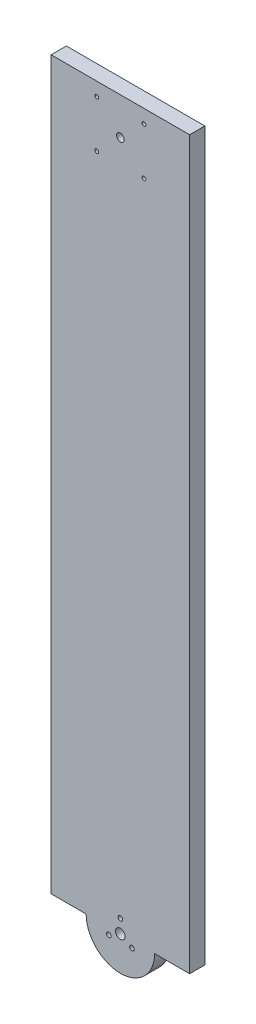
ISO-10303-21;
HEADER;
FILE_DESCRIPTION(('STEP AP214'),'2;1');
FILE_NAME('part.step','',(''),(''),'','','');
FILE_SCHEMA(('AUTOMOTIVE_DESIGN { 1 0 10303 214 1 1 1 1 }'));
ENDSEC;
DATA;
#1=APPLICATION_CONTEXT('core data for automotive mechanical design processes');
#2=APPLICATION_PROTOCOL_DEFINITION('international standard','automotive_design',2000,#1);
#3=PRODUCT_CONTEXT('',#1,'mechanical');
#4=PRODUCT('Part','Part','',(#3));
#5=PRODUCT_RELATED_PRODUCT_CATEGORY('part','',(#4));
#6=PRODUCT_DEFINITION_FORMATION('','',#4);
#7=PRODUCT_DEFINITION_CONTEXT('part definition',#1,'design');
#8=PRODUCT_DEFINITION('design','',#6,#7);
#9=PRODUCT_DEFINITION_SHAPE('','',#8);
#10=(LENGTH_UNIT() NAMED_UNIT(*) SI_UNIT(.MILLI.,.METRE.));
#11=(NAMED_UNIT(*) PLANE_ANGLE_UNIT() SI_UNIT($,.RADIAN.));
#12=(NAMED_UNIT(*) SI_UNIT($,.STERADIAN.) SOLID_ANGLE_UNIT());
#13=UNCERTAINTY_MEASURE_WITH_UNIT(LENGTH_MEASURE(1.E-05),#10,'distance_accuracy_value','');
#14=(GEOMETRIC_REPRESENTATION_CONTEXT(3) GLOBAL_UNCERTAINTY_ASSIGNED_CONTEXT((#13)) GLOBAL_UNIT_ASSIGNED_CONTEXT((#10,
#11,#12)) REPRESENTATION_CONTEXT('',''));
#15=CARTESIAN_POINT('',(0.,0.,0.));
#16=DIRECTION('',(0.,0.,1.));
#17=DIRECTION('',(1.,0.,0.));
#18=AXIS2_PLACEMENT_3D('',#15,#16,#17);
#19=CARTESIAN_POINT('',(-5.03416752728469E-12,-347.5,10.));
#20=DIRECTION('',(0.,0.,1.));
#21=DIRECTION('',(1.,0.,0.));
#22=AXIS2_PLACEMENT_3D('',#19,#20,#21);
#23=PLANE('',#22);
#24=CARTESIAN_POINT('',(7.57772228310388,-351.875000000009,10.));
#25=DIRECTION('',(0.,0.,1.));
#26=DIRECTION('',(1.,0.,0.));
#27=AXIS2_PLACEMENT_3D('',#24,#25,#26);
#28=CIRCLE('',#27,1.49999999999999);
#29=CARTESIAN_POINT('',(9.07772228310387,-351.875000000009,10.));
#30=VERTEX_POINT('',#29);
#31=EDGE_CURVE('E136',#30,#30,#28,.T.);
#32=ORIENTED_EDGE('',*,*,#31,.F.);
#33=EDGE_LOOP('',(#32));
#34=FACE_BOUND('',#33,.T.);
#35=CARTESIAN_POINT('',(5.46489483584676E-12,-338.75,10.));
#36=DIRECTION('',(0.,0.,1.));
#37=DIRECTION('',(1.,0.,0.));
#38=AXIS2_PLACEMENT_3D('',#35,#36,#37);
#39=CIRCLE('',#38,1.5);
#40=CARTESIAN_POINT('',(1.50000000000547,-338.75,10.));
#41=VERTEX_POINT('',#40);
#42=EDGE_CURVE('E148',#41,#41,#39,.T.);
#43=ORIENTED_EDGE('',*,*,#42,.F.);
#44=EDGE_LOOP('',(#43));
#45=FACE_BOUND('',#44,.T.);
#46=CARTESIAN_POINT('',(-15.4999999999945,90.1639203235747,10.));
#47=DIRECTION('',(0.,0.,1.));
#48=DIRECTION('',(-1.,0.,0.));
#49=AXIS2_PLACEMENT_3D('',#46,#47,#48);
#50=CIRCLE('',#49,1.25);
#51=CARTESIAN_POINT('',(-16.7499999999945,90.1639203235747,10.));
#52=VERTEX_POINT('',#51);
#53=EDGE_CURVE('E160',#52,#52,#50,.T.);
#54=ORIENTED_EDGE('',*,*,#53,.F.);
#55=EDGE_LOOP('',(#54));
#56=FACE_BOUND('',#55,.T.);
#57=CARTESIAN_POINT('',(15.5000000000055,121.163920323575,10.));
#58=DIRECTION('',(0.,0.,1.));
#59=DIRECTION('',(-1.,0.,0.));
#60=AXIS2_PLACEMENT_3D('',#57,#58,#59);
#61=CIRCLE('',#60,1.25);
#62=CARTESIAN_POINT('',(14.2500000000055,121.163920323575,10.));
#63=VERTEX_POINT('',#62);
#64=EDGE_CURVE('E172',#63,#63,#61,.T.);
#65=ORIENTED_EDGE('',*,*,#64,.F.);
#66=EDGE_LOOP('',(#65));
#67=FACE_BOUND('',#66,.T.);
#68=DIRECTION('',(-1.,0.,0.));
#69=VECTOR('',#68,1.);
#70=CARTESIAN_POINT('',(-22.5,130.,10.));
#71=LINE('',#70,#69);
#72=CARTESIAN_POINT('',(45.500000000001,130.,10.));
#73=VERTEX_POINT('',#72);
#74=CARTESIAN_POINT('',(-45.499999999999,130.,10.));
#75=VERTEX_POINT('',#74);
#76=EDGE_CURVE('E184',#73,#75,#71,.T.);
#77=ORIENTED_EDGE('',*,*,#76,.T.);
#78=DIRECTION('',(0.,1.,0.));
#79=VECTOR('',#78,1.);
#80=CARTESIAN_POINT('',(-45.499999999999,130.,10.));
#81=LINE('',#80,#79);
#82=CARTESIAN_POINT('',(-45.5000000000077,-347.5,10.));
#83=VERTEX_POINT('',#82);
#84=EDGE_CURVE('E95',#83,#75,#81,.T.);
#85=ORIENTED_EDGE('',*,*,#84,.F.);
#86=DIRECTION('',(1.,0.,0.));
#87=VECTOR('',#86,1.);
#88=CARTESIAN_POINT('',(-45.5000000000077,-347.5,10.));
#89=LINE('',#88,#87);
#90=CARTESIAN_POINT('',(-22.500000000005,-347.5,10.));
#91=VERTEX_POINT('',#90);
#92=EDGE_CURVE('E91',#83,#91,#89,.T.);
#93=ORIENTED_EDGE('',*,*,#92,.T.);
#94=CARTESIAN_POINT('',(-5.03416752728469E-12,-347.5,10.));
#95=DIRECTION('',(0.,0.,1.));
#96=DIRECTION('',(1.,0.,0.));
#97=AXIS2_PLACEMENT_3D('',#94,#95,#96);
#98=CIRCLE('',#97,22.5);
#99=CARTESIAN_POINT('',(22.4999999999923,-347.5,9.99999999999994));
#100=VERTEX_POINT('',#99);
#101=EDGE_CURVE('E49',#91,#100,#98,.T.);
#102=ORIENTED_EDGE('',*,*,#101,.T.);
#103=DIRECTION('',(-1.,0.,0.));
#104=VECTOR('',#103,1.);
#105=CARTESIAN_POINT('',(45.4999999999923,-347.5,9.99999999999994));
#106=LINE('',#105,#104);
#107=CARTESIAN_POINT('',(45.4999999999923,-347.5,9.99999999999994));
#108=VERTEX_POINT('',#107);
#109=EDGE_CURVE('E127',#108,#100,#106,.T.);
#110=ORIENTED_EDGE('',*,*,#109,.F.);
#111=DIRECTION('',(0.,-1.,0.));
#112=VECTOR('',#111,1.);
#113=CARTESIAN_POINT('',(45.500000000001,130.,10.));
#114=LINE('',#113,#112);
#115=EDGE_CURVE('E110',#73,#108,#114,.T.);
#116=ORIENTED_EDGE('',*,*,#115,.F.);
#117=EDGE_LOOP('',(#77,#85,#93,#102,#110,#116));
#118=FACE_BOUND('',#117,.T.);
#119=CARTESIAN_POINT('',(-15.4999999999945,121.163920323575,10.));
#120=DIRECTION('',(0.,0.,1.));
#121=DIRECTION('',(1.,0.,0.));
#122=AXIS2_PLACEMENT_3D('',#119,#120,#121);
#123=CIRCLE('',#122,1.25);
#124=CARTESIAN_POINT('',(-14.2499999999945,121.163920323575,10.));
#125=VERTEX_POINT('',#124);
#126=EDGE_CURVE('E178',#125,#125,#123,.T.);
#127=ORIENTED_EDGE('',*,*,#126,.F.);
#128=EDGE_LOOP('',(#127));
#129=FACE_BOUND('',#128,.T.);
#130=CARTESIAN_POINT('',(15.5000000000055,90.1639203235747,10.));
#131=DIRECTION('',(0.,0.,1.));
#132=DIRECTION('',(1.,0.,0.));
#133=AXIS2_PLACEMENT_3D('',#130,#131,#132);
#134=CIRCLE('',#133,1.25);
#135=CARTESIAN_POINT('',(16.7500000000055,90.1639203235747,10.));
#136=VERTEX_POINT('',#135);
#137=EDGE_CURVE('E166',#136,#136,#134,.T.);
#138=ORIENTED_EDGE('',*,*,#137,.F.);
#139=EDGE_LOOP('',(#138));
#140=FACE_BOUND('',#139,.T.);
#141=CARTESIAN_POINT('',(5.4678483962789E-12,105.663920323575,10.));
#142=DIRECTION('',(0.,0.,1.));
#143=DIRECTION('',(1.,0.,0.));
#144=AXIS2_PLACEMENT_3D('',#141,#142,#143);
#145=CIRCLE('',#144,2.5);
#146=CARTESIAN_POINT('',(2.50000000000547,105.663920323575,10.));
#147=VERTEX_POINT('',#146);
#148=EDGE_CURVE('E154',#147,#147,#145,.T.);
#149=ORIENTED_EDGE('',*,*,#148,.F.);
#150=EDGE_LOOP('',(#149));
#151=FACE_BOUND('',#150,.T.);
#152=CARTESIAN_POINT('',(-5.03416752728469E-12,-347.5,10.));
#153=DIRECTION('',(0.,0.,1.));
#154=DIRECTION('',(1.,0.,0.));
#155=AXIS2_PLACEMENT_3D('',#152,#153,#154);
#156=CIRCLE('',#155,3.15000000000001);
#157=CARTESIAN_POINT('',(3.14999999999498,-347.5,10.));
#158=VERTEX_POINT('',#157);
#159=EDGE_CURVE('E142',#158,#158,#156,.T.);
#160=ORIENTED_EDGE('',*,*,#159,.F.);
#161=EDGE_LOOP('',(#160));
#162=FACE_BOUND('',#161,.T.);
#163=CARTESIAN_POINT('',(-7.5777222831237,-351.874999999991,10.));
#164=DIRECTION('',(0.,0.,1.));
#165=DIRECTION('',(1.,0.,0.));
#166=AXIS2_PLACEMENT_3D('',#163,#164,#165);
#167=CIRCLE('',#166,1.49999999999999);
#168=CARTESIAN_POINT('',(-6.07772228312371,-351.874999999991,10.));
#169=VERTEX_POINT('',#168);
#170=EDGE_CURVE('E130',#169,#169,#167,.T.);
#171=ORIENTED_EDGE('',*,*,#170,.F.);
#172=EDGE_LOOP('',(#171));
#173=FACE_BOUND('',#172,.T.);
#174=ADVANCED_FACE('F35',(#34,#45,#56,#67,#118,#129,#140,#151,#162,#173),#23,.T.);
#175=CARTESIAN_POINT('',(-5.03416752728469E-12,-347.5,0.));
#176=DIRECTION('',(0.,0.,1.));
#177=DIRECTION('',(1.,0.,0.));
#178=AXIS2_PLACEMENT_3D('',#175,#176,#177);
#179=PLANE('',#178);
#180=CARTESIAN_POINT('',(-5.03416752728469E-12,-347.5,0.));
#181=DIRECTION('',(0.,0.,1.));
#182=DIRECTION('',(1.,0.,0.));
#183=AXIS2_PLACEMENT_3D('',#180,#181,#182);
#184=CIRCLE('',#183,22.5);
#185=CARTESIAN_POINT('',(-22.500000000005,-347.5,0.));
#186=VERTEX_POINT('',#185);
#187=CARTESIAN_POINT('',(22.4999999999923,-347.5,0.));
#188=VERTEX_POINT('',#187);
#189=EDGE_CURVE('E109',#186,#188,#184,.T.);
#190=ORIENTED_EDGE('',*,*,#189,.F.);
#191=DIRECTION('',(1.,0.,0.));
#192=VECTOR('',#191,1.);
#193=CARTESIAN_POINT('',(-45.5000000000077,-347.5,0.));
#194=LINE('',#193,#192);
#195=CARTESIAN_POINT('',(-45.5000000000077,-347.5,0.));
#196=VERTEX_POINT('',#195);
#197=EDGE_CURVE('E89',#196,#186,#194,.T.);
#198=ORIENTED_EDGE('',*,*,#197,.F.);
#199=DIRECTION('',(0.,-1.,0.));
#200=VECTOR('',#199,1.);
#201=CARTESIAN_POINT('',(-45.499999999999,130.,0.));
#202=LINE('',#201,#200);
#203=CARTESIAN_POINT('',(-45.499999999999,130.,0.));
#204=VERTEX_POINT('',#203);
#205=EDGE_CURVE('E96',#204,#196,#202,.T.);
#206=ORIENTED_EDGE('',*,*,#205,.F.);
#207=DIRECTION('',(-1.,0.,0.));
#208=VECTOR('',#207,1.);
#209=CARTESIAN_POINT('',(-22.5,130.,0.));
#210=LINE('',#209,#208);
#211=CARTESIAN_POINT('',(45.500000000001,130.,0.));
#212=VERTEX_POINT('',#211);
#213=EDGE_CURVE('E185',#212,#204,#210,.T.);
#214=ORIENTED_EDGE('',*,*,#213,.F.);
#215=DIRECTION('',(0.,1.,0.));
#216=VECTOR('',#215,1.);
#217=CARTESIAN_POINT('',(45.500000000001,130.,0.));
#218=LINE('',#217,#216);
#219=CARTESIAN_POINT('',(45.4999999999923,-347.5,0.));
#220=VERTEX_POINT('',#219);
#221=EDGE_CURVE('E119',#220,#212,#218,.T.);
#222=ORIENTED_EDGE('',*,*,#221,.F.);
#223=DIRECTION('',(-1.,0.,0.));
#224=VECTOR('',#223,1.);
#225=CARTESIAN_POINT('',(45.4999999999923,-347.5,0.));
#226=LINE('',#225,#224);
#227=EDGE_CURVE('E125',#220,#188,#226,.T.);
#228=ORIENTED_EDGE('',*,*,#227,.T.);
#229=EDGE_LOOP('',(#190,#198,#206,#214,#222,#228));
#230=FACE_BOUND('',#229,.T.);
#231=CARTESIAN_POINT('',(-15.4999999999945,121.163920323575,0.));
#232=DIRECTION('',(0.,0.,1.));
#233=DIRECTION('',(1.,0.,0.));
#234=AXIS2_PLACEMENT_3D('',#231,#232,#233);
#235=CIRCLE('',#234,1.25);
#236=CARTESIAN_POINT('',(-14.2499999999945,121.163920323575,0.));
#237=VERTEX_POINT('',#236);
#238=EDGE_CURVE('E175',#237,#237,#235,.T.);
#239=ORIENTED_EDGE('',*,*,#238,.T.);
#240=EDGE_LOOP('',(#239));
#241=FACE_BOUND('',#240,.T.);
#242=CARTESIAN_POINT('',(15.5000000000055,121.163920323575,0.));
#243=DIRECTION('',(0.,0.,1.));
#244=DIRECTION('',(-1.,0.,0.));
#245=AXIS2_PLACEMENT_3D('',#242,#243,#244);
#246=CIRCLE('',#245,1.25);
#247=CARTESIAN_POINT('',(14.2500000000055,121.163920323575,0.));
#248=VERTEX_POINT('',#247);
#249=EDGE_CURVE('E169',#248,#248,#246,.T.);
#250=ORIENTED_EDGE('',*,*,#249,.T.);
#251=EDGE_LOOP('',(#250));
#252=FACE_BOUND('',#251,.T.);
#253=CARTESIAN_POINT('',(15.5000000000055,90.1639203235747,0.));
#254=DIRECTION('',(0.,0.,1.));
#255=DIRECTION('',(1.,0.,0.));
#256=AXIS2_PLACEMENT_3D('',#253,#254,#255);
#257=CIRCLE('',#256,1.25);
#258=CARTESIAN_POINT('',(16.7500000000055,90.1639203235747,0.));
#259=VERTEX_POINT('',#258);
#260=EDGE_CURVE('E163',#259,#259,#257,.T.);
#261=ORIENTED_EDGE('',*,*,#260,.T.);
#262=EDGE_LOOP('',(#261));
#263=FACE_BOUND('',#262,.T.);
#264=CARTESIAN_POINT('',(-15.4999999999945,90.1639203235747,0.));
#265=DIRECTION('',(0.,0.,1.));
#266=DIRECTION('',(-1.,0.,0.));
#267=AXIS2_PLACEMENT_3D('',#264,#265,#266);
#268=CIRCLE('',#267,1.25);
#269=CARTESIAN_POINT('',(-16.7499999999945,90.1639203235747,0.));
#270=VERTEX_POINT('',#269);
#271=EDGE_CURVE('E157',#270,#270,#268,.T.);
#272=ORIENTED_EDGE('',*,*,#271,.T.);
#273=EDGE_LOOP('',(#272));
#274=FACE_BOUND('',#273,.T.);
#275=CARTESIAN_POINT('',(5.4678483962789E-12,105.663920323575,0.));
#276=DIRECTION('',(0.,0.,1.));
#277=DIRECTION('',(1.,0.,0.));
#278=AXIS2_PLACEMENT_3D('',#275,#276,#277);
#279=CIRCLE('',#278,2.5);
#280=CARTESIAN_POINT('',(2.50000000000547,105.663920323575,0.));
#281=VERTEX_POINT('',#280);
#282=EDGE_CURVE('E151',#281,#281,#279,.T.);
#283=ORIENTED_EDGE('',*,*,#282,.T.);
#284=EDGE_LOOP('',(#283));
#285=FACE_BOUND('',#284,.T.);
#286=CARTESIAN_POINT('',(5.46489483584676E-12,-338.75,0.));
#287=DIRECTION('',(0.,0.,1.));
#288=DIRECTION('',(1.,0.,0.));
#289=AXIS2_PLACEMENT_3D('',#286,#287,#288);
#290=CIRCLE('',#289,1.5);
#291=CARTESIAN_POINT('',(1.50000000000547,-338.75,0.));
#292=VERTEX_POINT('',#291);
#293=EDGE_CURVE('E145',#292,#292,#290,.T.);
#294=ORIENTED_EDGE('',*,*,#293,.T.);
#295=EDGE_LOOP('',(#294));
#296=FACE_BOUND('',#295,.T.);
#297=CARTESIAN_POINT('',(-5.03416752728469E-12,-347.5,0.));
#298=DIRECTION('',(0.,0.,1.));
#299=DIRECTION('',(1.,0.,0.));
#300=AXIS2_PLACEMENT_3D('',#297,#298,#299);
#301=CIRCLE('',#300,3.15000000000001);
#302=CARTESIAN_POINT('',(3.14999999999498,-347.5,0.));
#303=VERTEX_POINT('',#302);
#304=EDGE_CURVE('E139',#303,#303,#301,.T.);
#305=ORIENTED_EDGE('',*,*,#304,.T.);
#306=EDGE_LOOP('',(#305));
#307=FACE_BOUND('',#306,.T.);
#308=CARTESIAN_POINT('',(7.57772228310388,-351.875000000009,0.));
#309=DIRECTION('',(0.,0.,1.));
#310=DIRECTION('',(1.,0.,0.));
#311=AXIS2_PLACEMENT_3D('',#308,#309,#310);
#312=CIRCLE('',#311,1.49999999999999);
#313=CARTESIAN_POINT('',(9.07772228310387,-351.875000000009,0.));
#314=VERTEX_POINT('',#313);
#315=EDGE_CURVE('E133',#314,#314,#312,.T.);
#316=ORIENTED_EDGE('',*,*,#315,.T.);
#317=EDGE_LOOP('',(#316));
#318=FACE_BOUND('',#317,.T.);
#319=CARTESIAN_POINT('',(-7.5777222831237,-351.874999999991,0.));
#320=DIRECTION('',(0.,0.,1.));
#321=DIRECTION('',(1.,0.,0.));
#322=AXIS2_PLACEMENT_3D('',#319,#320,#321);
#323=CIRCLE('',#322,1.49999999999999);
#324=CARTESIAN_POINT('',(-6.07772228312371,-351.874999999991,0.));
#325=VERTEX_POINT('',#324);
#326=EDGE_CURVE('E129',#325,#325,#323,.T.);
#327=ORIENTED_EDGE('',*,*,#326,.T.);
#328=EDGE_LOOP('',(#327));
#329=FACE_BOUND('',#328,.T.);
#330=ADVANCED_FACE('F105',(#230,#241,#252,#263,#274,#285,#296,#307,#318,#329),#179,.F.);
#331=CARTESIAN_POINT('',(-5.03416752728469E-12,-347.5,10.));
#332=DIRECTION('',(0.,0.,-1.));
#333=DIRECTION('',(-1.,0.,0.));
#334=AXIS2_PLACEMENT_3D('',#331,#332,#333);
#335=CYLINDRICAL_SURFACE('',#334,22.5);
#336=ORIENTED_EDGE('',*,*,#189,.T.);
#337=DIRECTION('',(0.,0.,-1.));
#338=VECTOR('',#337,1.);
#339=CARTESIAN_POINT('',(22.499999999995,-347.5,10.));
#340=LINE('',#339,#338);
#341=EDGE_CURVE('E44',#100,#188,#340,.T.);
#342=ORIENTED_EDGE('',*,*,#341,.F.);
#343=ORIENTED_EDGE('',*,*,#101,.F.);
#344=DIRECTION('',(0.,0.,-1.));
#345=VECTOR('',#344,1.);
#346=CARTESIAN_POINT('',(-22.500000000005,-347.5,10.));
#347=LINE('',#346,#345);
#348=EDGE_CURVE('E11',#91,#186,#347,.T.);
#349=ORIENTED_EDGE('',*,*,#348,.T.);
#350=EDGE_LOOP('',(#336,#342,#343,#349));
#351=FACE_BOUND('',#350,.T.);
#352=ADVANCED_FACE('F37',(#351),#335,.T.);
#353=CARTESIAN_POINT('',(-22.5,130.,10.));
#354=DIRECTION('',(0.,-1.,0.));
#355=DIRECTION('',(0.,0.,-1.));
#356=AXIS2_PLACEMENT_3D('',#353,#354,#355);
#357=PLANE('',#356);
#358=ORIENTED_EDGE('',*,*,#213,.T.);
#359=DIRECTION('',(0.,0.,-1.));
#360=VECTOR('',#359,1.);
#361=CARTESIAN_POINT('',(-45.499999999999,130.,0.));
#362=LINE('',#361,#360);
#363=EDGE_CURVE('E102',#75,#204,#362,.T.);
#364=ORIENTED_EDGE('',*,*,#363,.F.);
#365=ORIENTED_EDGE('',*,*,#76,.F.);
#366=DIRECTION('',(0.,0.,1.));
#367=VECTOR('',#366,1.);
#368=CARTESIAN_POINT('',(45.500000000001,130.,10.));
#369=LINE('',#368,#367);
#370=EDGE_CURVE('E122',#212,#73,#369,.T.);
#371=ORIENTED_EDGE('',*,*,#370,.F.);
#372=EDGE_LOOP('',(#358,#364,#365,#371));
#373=FACE_BOUND('',#372,.T.);
#374=ADVANCED_FACE('F198',(#373),#357,.F.);
#375=CARTESIAN_POINT('',(-15.4999999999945,121.163920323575,10.));
#376=DIRECTION('',(0.,0.,-1.));
#377=DIRECTION('',(-1.,0.,0.));
#378=AXIS2_PLACEMENT_3D('',#375,#376,#377);
#379=CYLINDRICAL_SURFACE('',#378,1.25);
#380=ORIENTED_EDGE('',*,*,#126,.T.);
#381=EDGE_LOOP('',(#380));
#382=FACE_BOUND('',#381,.T.);
#383=ORIENTED_EDGE('',*,*,#238,.F.);
#384=EDGE_LOOP('',(#383));
#385=FACE_BOUND('',#384,.T.);
#386=ADVANCED_FACE('F221',(#382,#385),#379,.F.);
#387=CARTESIAN_POINT('',(15.5000000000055,121.163920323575,10.));
#388=DIRECTION('',(0.,0.,-1.));
#389=DIRECTION('',(-1.,0.,0.));
#390=AXIS2_PLACEMENT_3D('',#387,#388,#389);
#391=CYLINDRICAL_SURFACE('',#390,1.25);
#392=ORIENTED_EDGE('',*,*,#64,.T.);
#393=EDGE_LOOP('',(#392));
#394=FACE_BOUND('',#393,.T.);
#395=ORIENTED_EDGE('',*,*,#249,.F.);
#396=EDGE_LOOP('',(#395));
#397=FACE_BOUND('',#396,.T.);
#398=ADVANCED_FACE('F228',(#394,#397),#391,.F.);
#399=CARTESIAN_POINT('',(15.5000000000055,90.1639203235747,10.));
#400=DIRECTION('',(0.,0.,-1.));
#401=DIRECTION('',(-1.,0.,0.));
#402=AXIS2_PLACEMENT_3D('',#399,#400,#401);
#403=CYLINDRICAL_SURFACE('',#402,1.25);
#404=ORIENTED_EDGE('',*,*,#137,.T.);
#405=EDGE_LOOP('',(#404));
#406=FACE_BOUND('',#405,.T.);
#407=ORIENTED_EDGE('',*,*,#260,.F.);
#408=EDGE_LOOP('',(#407));
#409=FACE_BOUND('',#408,.T.);
#410=ADVANCED_FACE('F313',(#406,#409),#403,.F.);
#411=CARTESIAN_POINT('',(-15.4999999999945,90.1639203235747,10.));
#412=DIRECTION('',(0.,0.,-1.));
#413=DIRECTION('',(-1.,0.,0.));
#414=AXIS2_PLACEMENT_3D('',#411,#412,#413);
#415=CYLINDRICAL_SURFACE('',#414,1.25);
#416=ORIENTED_EDGE('',*,*,#53,.T.);
#417=EDGE_LOOP('',(#416));
#418=FACE_BOUND('',#417,.T.);
#419=ORIENTED_EDGE('',*,*,#271,.F.);
#420=EDGE_LOOP('',(#419));
#421=FACE_BOUND('',#420,.T.);
#422=ADVANCED_FACE('F303',(#418,#421),#415,.F.);
#423=CARTESIAN_POINT('',(5.4678483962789E-12,105.663920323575,10.));
#424=DIRECTION('',(0.,0.,-1.));
#425=DIRECTION('',(-1.,0.,0.));
#426=AXIS2_PLACEMENT_3D('',#423,#424,#425);
#427=CYLINDRICAL_SURFACE('',#426,2.5);
#428=ORIENTED_EDGE('',*,*,#148,.T.);
#429=EDGE_LOOP('',(#428));
#430=FACE_BOUND('',#429,.T.);
#431=ORIENTED_EDGE('',*,*,#282,.F.);
#432=EDGE_LOOP('',(#431));
#433=FACE_BOUND('',#432,.T.);
#434=ADVANCED_FACE('F293',(#430,#433),#427,.F.);
#435=CARTESIAN_POINT('',(5.46489483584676E-12,-338.75,10.));
#436=DIRECTION('',(0.,0.,-1.));
#437=DIRECTION('',(-1.,0.,0.));
#438=AXIS2_PLACEMENT_3D('',#435,#436,#437);
#439=CYLINDRICAL_SURFACE('',#438,1.5);
#440=ORIENTED_EDGE('',*,*,#42,.T.);
#441=EDGE_LOOP('',(#440));
#442=FACE_BOUND('',#441,.T.);
#443=ORIENTED_EDGE('',*,*,#293,.F.);
#444=EDGE_LOOP('',(#443));
#445=FACE_BOUND('',#444,.T.);
#446=ADVANCED_FACE('F283',(#442,#445),#439,.F.);
#447=CARTESIAN_POINT('',(-5.03416752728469E-12,-347.5,10.));
#448=DIRECTION('',(0.,0.,-1.));
#449=DIRECTION('',(-1.,0.,0.));
#450=AXIS2_PLACEMENT_3D('',#447,#448,#449);
#451=CYLINDRICAL_SURFACE('',#450,3.15000000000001);
#452=ORIENTED_EDGE('',*,*,#159,.T.);
#453=EDGE_LOOP('',(#452));
#454=FACE_BOUND('',#453,.T.);
#455=ORIENTED_EDGE('',*,*,#304,.F.);
#456=EDGE_LOOP('',(#455));
#457=FACE_BOUND('',#456,.T.);
#458=ADVANCED_FACE('F273',(#454,#457),#451,.F.);
#459=CARTESIAN_POINT('',(7.57772228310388,-351.875000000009,10.));
#460=DIRECTION('',(0.,0.,-1.));
#461=DIRECTION('',(-1.,0.,0.));
#462=AXIS2_PLACEMENT_3D('',#459,#460,#461);
#463=CYLINDRICAL_SURFACE('',#462,1.49999999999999);
#464=ORIENTED_EDGE('',*,*,#31,.T.);
#465=EDGE_LOOP('',(#464));
#466=FACE_BOUND('',#465,.T.);
#467=ORIENTED_EDGE('',*,*,#315,.F.);
#468=EDGE_LOOP('',(#467));
#469=FACE_BOUND('',#468,.T.);
#470=ADVANCED_FACE('F263',(#466,#469),#463,.F.);
#471=CARTESIAN_POINT('',(-7.5777222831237,-351.874999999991,10.));
#472=DIRECTION('',(0.,0.,-1.));
#473=DIRECTION('',(-1.,0.,0.));
#474=AXIS2_PLACEMENT_3D('',#471,#472,#473);
#475=CYLINDRICAL_SURFACE('',#474,1.49999999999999);
#476=ORIENTED_EDGE('',*,*,#170,.T.);
#477=EDGE_LOOP('',(#476));
#478=FACE_BOUND('',#477,.T.);
#479=ORIENTED_EDGE('',*,*,#326,.F.);
#480=EDGE_LOOP('',(#479));
#481=FACE_BOUND('',#480,.T.);
#482=ADVANCED_FACE('F209',(#478,#481),#475,.F.);
#483=CARTESIAN_POINT('',(45.4999999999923,-347.5,9.99999999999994));
#484=DIRECTION('',(0.,1.,0.));
#485=DIRECTION('',(-1.,0.,0.));
#486=AXIS2_PLACEMENT_3D('',#483,#484,#485);
#487=PLANE('',#486);
#488=ORIENTED_EDGE('',*,*,#341,.T.);
#489=ORIENTED_EDGE('',*,*,#227,.F.);
#490=DIRECTION('',(0.,0.,-1.));
#491=VECTOR('',#490,1.);
#492=CARTESIAN_POINT('',(45.4999999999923,-347.5,9.99999999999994));
#493=LINE('',#492,#491);
#494=EDGE_CURVE('E113',#108,#220,#493,.T.);
#495=ORIENTED_EDGE('',*,*,#494,.F.);
#496=ORIENTED_EDGE('',*,*,#109,.T.);
#497=EDGE_LOOP('',(#488,#489,#495,#496));
#498=FACE_BOUND('',#497,.T.);
#499=ADVANCED_FACE('F190',(#498),#487,.F.);
#500=CARTESIAN_POINT('',(45.4999999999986,-8.31729645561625E-13,0.));
#501=DIRECTION('',(1.,0.,0.));
#502=DIRECTION('',(0.,1.,0.));
#503=AXIS2_PLACEMENT_3D('',#500,#501,#502);
#504=PLANE('',#503);
#505=ORIENTED_EDGE('',*,*,#115,.T.);
#506=ORIENTED_EDGE('',*,*,#494,.T.);
#507=ORIENTED_EDGE('',*,*,#221,.T.);
#508=ORIENTED_EDGE('',*,*,#370,.T.);
#509=EDGE_LOOP('',(#505,#506,#507,#508));
#510=FACE_BOUND('',#509,.T.);
#511=ADVANCED_FACE('F201',(#510),#504,.T.);
#512=CARTESIAN_POINT('',(-45.5000000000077,-347.5,0.));
#513=DIRECTION('',(0.,1.,0.));
#514=DIRECTION('',(-1.,0.,0.));
#515=AXIS2_PLACEMENT_3D('',#512,#513,#514);
#516=PLANE('',#515);
#517=ORIENTED_EDGE('',*,*,#348,.F.);
#518=ORIENTED_EDGE('',*,*,#92,.F.);
#519=DIRECTION('',(0.,0.,1.));
#520=VECTOR('',#519,1.);
#521=CARTESIAN_POINT('',(-45.5000000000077,-347.5,0.));
#522=LINE('',#521,#520);
#523=EDGE_CURVE('E85',#196,#83,#522,.T.);
#524=ORIENTED_EDGE('',*,*,#523,.F.);
#525=ORIENTED_EDGE('',*,*,#197,.T.);
#526=EDGE_LOOP('',(#517,#518,#524,#525));
#527=FACE_BOUND('',#526,.T.);
#528=ADVANCED_FACE('F87',(#527),#516,.F.);
#529=CARTESIAN_POINT('',(-45.5000000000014,8.31729645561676E-13,0.));
#530=DIRECTION('',(-1.,0.,0.));
#531=DIRECTION('',(0.,-1.,0.));
#532=AXIS2_PLACEMENT_3D('',#529,#530,#531);
#533=PLANE('',#532);
#534=ORIENTED_EDGE('',*,*,#205,.T.);
#535=ORIENTED_EDGE('',*,*,#523,.T.);
#536=ORIENTED_EDGE('',*,*,#84,.T.);
#537=ORIENTED_EDGE('',*,*,#363,.T.);
#538=EDGE_LOOP('',(#534,#535,#536,#537));
#539=FACE_BOUND('',#538,.T.);
#540=ADVANCED_FACE('F100',(#539),#533,.T.);
#541=CLOSED_SHELL('',(#174,#330,#352,#374,#386,#398,#410,#422,#434,#446,#458,#470,#482,#499,
#511,#528,#540));
#542=MANIFOLD_SOLID_BREP('B2',#541);
#543=ADVANCED_BREP_SHAPE_REPRESENTATION('',(#18,#542),#14);
#544=SHAPE_DEFINITION_REPRESENTATION(#9,#543);
ENDSEC;
END-ISO-10303-21;
